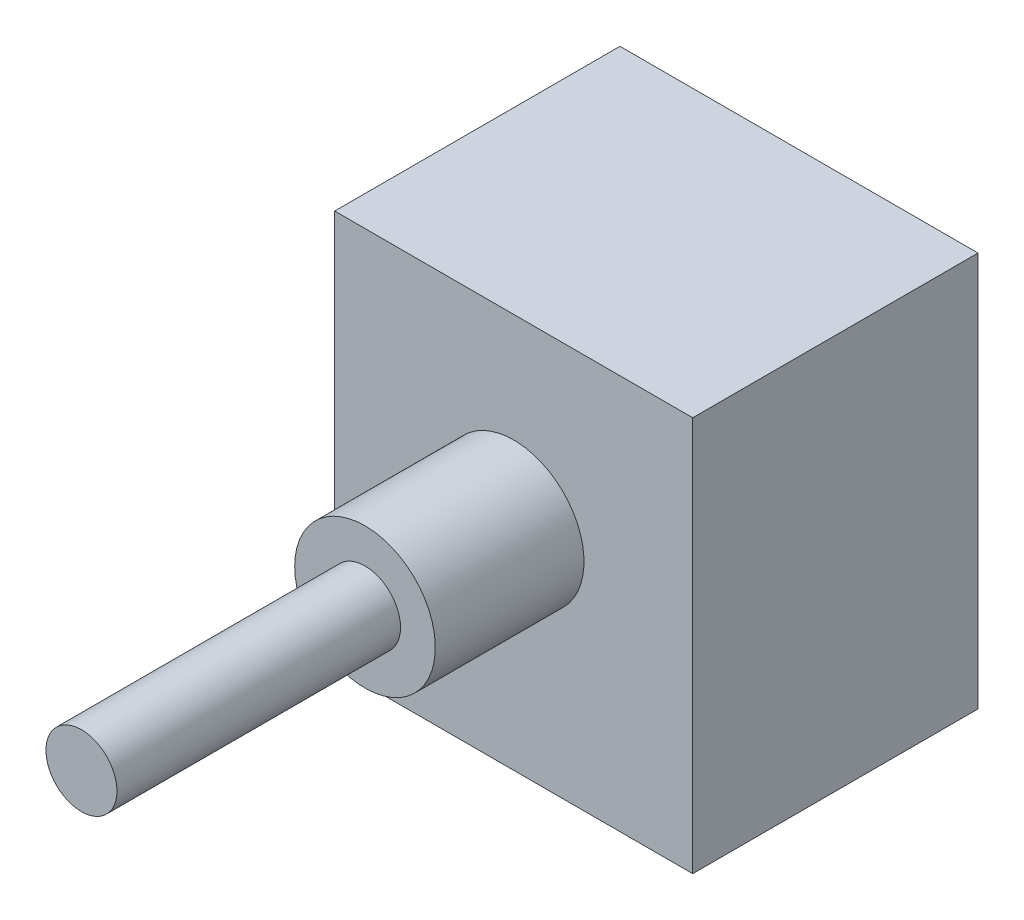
from build123d import *

# Parameters (mm, degrees)
SKETCH1_W           = 15.8115
SKETCH1_H           = 17.4371
BOSS_EXTRUDE1_DEPTH = 12.5984
SKETCH2_R           = 3.10515
BOSS_EXTRUDE2_DEPTH = 6.5659
SKETCH3_R           = 1.56845
BOSS_EXTRUDE3_DEPTH = 12.5222
SKETCH4_R           = 0.4445
BOSS_EXTRUDE4_DEPTH = 1.016


with BuildPart() as part:
    # Sketch1 → Boss-Extrude1 (new body)
    with BuildSketch(Plane.XY):
        Rectangle(SKETCH1_W, SKETCH1_H)
    extrude(amount=BOSS_EXTRUDE1_DEPTH)

    # Sketch2 → Boss-Extrude2 (add)
    with BuildSketch(Plane.XY.offset(12.5984)):
        with Locations(Location((0, 0.8128, 0), (0, 0, 180))):
            Circle(SKETCH2_R)
    extrude(amount=BOSS_EXTRUDE2_DEPTH)

    # Sketch3 → Boss-Extrude3 (add)
    with BuildSketch(Plane.XY.offset(19.1643)):
        with Locations((0, 0.8128)):
            Circle(SKETCH3_R)
    extrude(amount=BOSS_EXTRUDE3_DEPTH)

    # Sketch4 → Boss-Extrude4 (add)
    with BuildSketch(Plane(origin=(0, 0, 0), x_dir=(-1, 0, 0), z_dir=(0, 0, -1))):
        with Locations((0, -7.62)):
            Circle(SKETCH4_R)
        with Locations((2.54, -7.62)):
            Circle(SKETCH4_R)
        with Locations((-2.54, -7.62)):
            Circle(SKETCH4_R)
    extrude(amount=BOSS_EXTRUDE4_DEPTH)


solid = part.part
